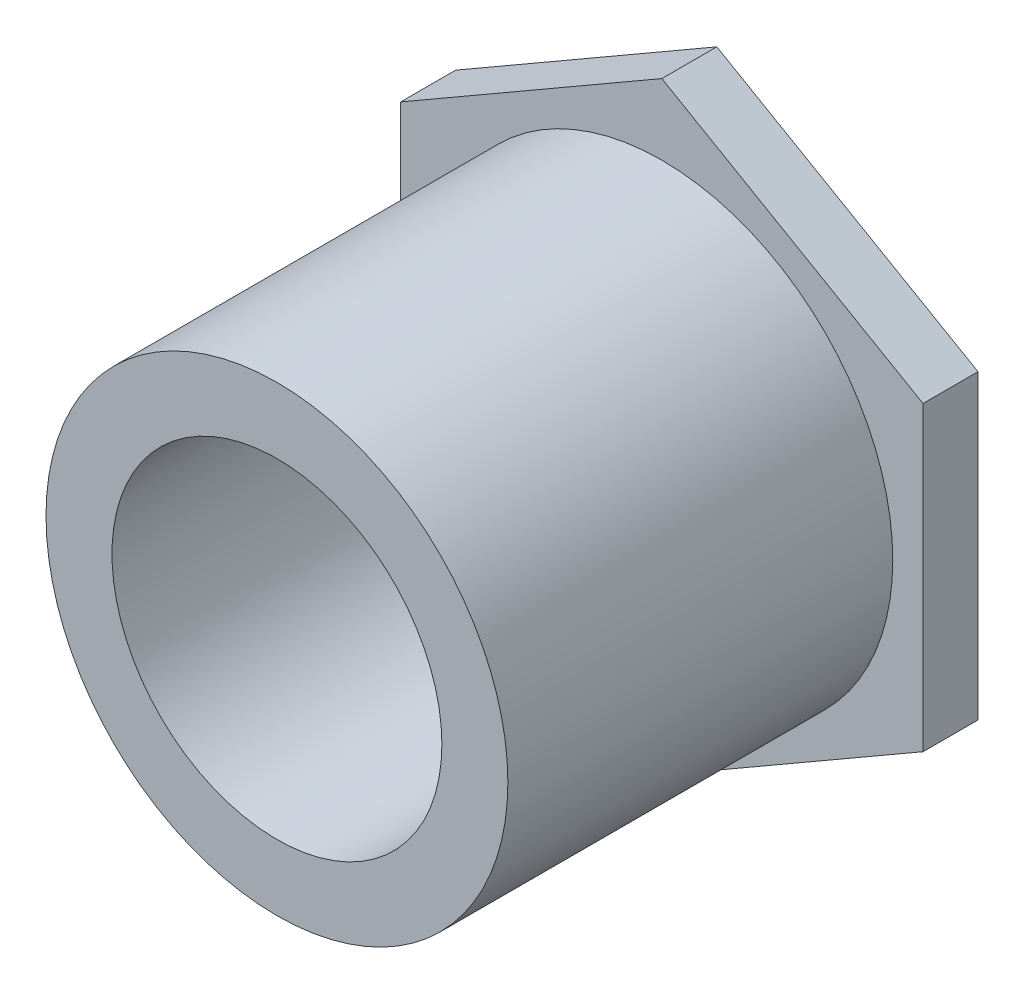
from build123d import *

# Parameters (mm, degrees)
SKETCH_1_R      = 2.1
SKETCH_1_R_2    = 1.5
EXTRUDE_1_DEPTH = 4
SKETCH_1_3_R    = 2.1
EXTRUDE_2_DEPTH = 0.5


with BuildPart() as part:
    # Sketch 1 → Extrude 1 (new body)
    with BuildSketch(Plane.XY):
        Circle(SKETCH_1_R)
        Circle(SKETCH_1_R_2, mode=Mode.SUBTRACT)
    extrude(amount=EXTRUDE_1_DEPTH)

    # Sketch 1_3 → Extrude 2 (add)
    with BuildSketch(Plane.XY):
        Polygon((2.375, -1.371206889), (2.375, 1.371206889), (0, 2.742413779), (-2.375, 1.371206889), (-2.375, -1.371206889), (0, -2.742413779), align=None)
        Circle(SKETCH_1_3_R, mode=Mode.SUBTRACT)
    extrude(amount=EXTRUDE_2_DEPTH)


solid = part.part
